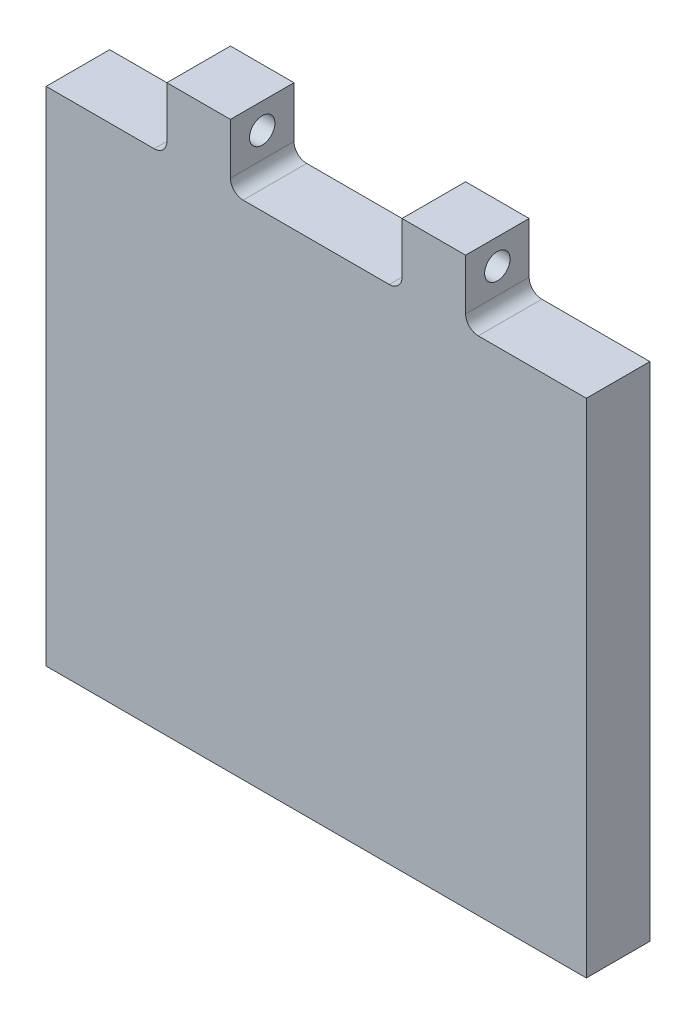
ISO-10303-21;
HEADER;
FILE_DESCRIPTION(('STEP AP214'),'2;1');
FILE_NAME('part.step','',(''),(''),'','','');
FILE_SCHEMA(('AUTOMOTIVE_DESIGN { 1 0 10303 214 1 1 1 1 }'));
ENDSEC;
DATA;
#1=APPLICATION_CONTEXT('core data for automotive mechanical design processes');
#2=APPLICATION_PROTOCOL_DEFINITION('international standard','automotive_design',2000,#1);
#3=PRODUCT_CONTEXT('',#1,'mechanical');
#4=PRODUCT('Part','Part','',(#3));
#5=PRODUCT_RELATED_PRODUCT_CATEGORY('part','',(#4));
#6=PRODUCT_DEFINITION_FORMATION('','',#4);
#7=PRODUCT_DEFINITION_CONTEXT('part definition',#1,'design');
#8=PRODUCT_DEFINITION('design','',#6,#7);
#9=PRODUCT_DEFINITION_SHAPE('','',#8);
#10=(LENGTH_UNIT() NAMED_UNIT(*) SI_UNIT(.MILLI.,.METRE.));
#11=(NAMED_UNIT(*) PLANE_ANGLE_UNIT() SI_UNIT($,.RADIAN.));
#12=(NAMED_UNIT(*) SI_UNIT($,.STERADIAN.) SOLID_ANGLE_UNIT());
#13=UNCERTAINTY_MEASURE_WITH_UNIT(LENGTH_MEASURE(1.E-05),#10,'distance_accuracy_value','');
#14=(GEOMETRIC_REPRESENTATION_CONTEXT(3) GLOBAL_UNCERTAINTY_ASSIGNED_CONTEXT((#13)) GLOBAL_UNIT_ASSIGNED_CONTEXT((#10,
#11,#12)) REPRESENTATION_CONTEXT('',''));
#15=CARTESIAN_POINT('',(0.,0.,0.));
#16=DIRECTION('',(0.,0.,1.));
#17=DIRECTION('',(1.,0.,0.));
#18=AXIS2_PLACEMENT_3D('',#15,#16,#17);
#19=CARTESIAN_POINT('',(-42.5,0.,-10.));
#20=DIRECTION('',(-1.,0.,0.));
#21=DIRECTION('',(0.,0.,1.));
#22=AXIS2_PLACEMENT_3D('',#19,#20,#21);
#23=PLANE('',#22);
#24=DIRECTION('',(0.,-1.,0.));
#25=VECTOR('',#24,1.);
#26=CARTESIAN_POINT('',(-42.5,0.,0.));
#27=LINE('',#26,#25);
#28=CARTESIAN_POINT('',(-42.5,79.,0.));
#29=VERTEX_POINT('',#28);
#30=CARTESIAN_POINT('',(-42.5,0.,0.));
#31=VERTEX_POINT('',#30);
#32=EDGE_CURVE('E139',#29,#31,#27,.T.);
#33=ORIENTED_EDGE('',*,*,#32,.F.);
#34=DIRECTION('',(0.,0.,1.));
#35=VECTOR('',#34,1.);
#36=CARTESIAN_POINT('',(-42.5,79.,-10.));
#37=LINE('',#36,#35);
#38=CARTESIAN_POINT('',(-42.5,79.,-10.));
#39=VERTEX_POINT('',#38);
#40=EDGE_CURVE('E11',#39,#29,#37,.T.);
#41=ORIENTED_EDGE('',*,*,#40,.F.);
#42=DIRECTION('',(0.,-1.,0.));
#43=VECTOR('',#42,1.);
#44=CARTESIAN_POINT('',(-42.5,0.,-10.));
#45=LINE('',#44,#43);
#46=CARTESIAN_POINT('',(-42.5,0.,-10.));
#47=VERTEX_POINT('',#46);
#48=EDGE_CURVE('E141',#39,#47,#45,.T.);
#49=ORIENTED_EDGE('',*,*,#48,.T.);
#50=DIRECTION('',(0.,0.,1.));
#51=VECTOR('',#50,1.);
#52=CARTESIAN_POINT('',(-42.5,0.,-10.));
#53=LINE('',#52,#51);
#54=EDGE_CURVE('E136',#47,#31,#53,.T.);
#55=ORIENTED_EDGE('',*,*,#54,.T.);
#56=EDGE_LOOP('',(#33,#41,#49,#55));
#57=FACE_BOUND('',#56,.T.);
#58=ADVANCED_FACE('F26',(#57),#23,.T.);
#59=CARTESIAN_POINT('',(-42.5,79.,-10.));
#60=DIRECTION('',(0.,1.,0.));
#61=DIRECTION('',(0.,0.,1.));
#62=AXIS2_PLACEMENT_3D('',#59,#60,#61);
#63=PLANE('',#62);
#64=DIRECTION('',(-1.,0.,0.));
#65=VECTOR('',#64,1.);
#66=CARTESIAN_POINT('',(-42.5,79.,0.));
#67=LINE('',#66,#65);
#68=CARTESIAN_POINT('',(-25.5,79.,0.));
#69=VERTEX_POINT('',#68);
#70=EDGE_CURVE('E157',#69,#29,#67,.T.);
#71=ORIENTED_EDGE('',*,*,#70,.F.);
#72=DIRECTION('',(0.,0.,1.));
#73=VECTOR('',#72,1.);
#74=CARTESIAN_POINT('',(-25.5,79.,-10.));
#75=LINE('',#74,#73);
#76=CARTESIAN_POINT('',(-25.5,79.,-10.));
#77=VERTEX_POINT('',#76);
#78=EDGE_CURVE('E34',#77,#69,#75,.T.);
#79=ORIENTED_EDGE('',*,*,#78,.F.);
#80=DIRECTION('',(-1.,0.,0.));
#81=VECTOR('',#80,1.);
#82=CARTESIAN_POINT('',(-42.5,79.,-10.));
#83=LINE('',#82,#81);
#84=EDGE_CURVE('E146',#77,#39,#83,.T.);
#85=ORIENTED_EDGE('',*,*,#84,.T.);
#86=ORIENTED_EDGE('',*,*,#40,.T.);
#87=EDGE_LOOP('',(#71,#79,#85,#86));
#88=FACE_BOUND('',#87,.T.);
#89=ADVANCED_FACE('F323',(#88),#63,.T.);
#90=CARTESIAN_POINT('',(-25.5,81.,-10.));
#91=DIRECTION('',(0.,0.,1.));
#92=DIRECTION('',(1.,0.,0.));
#93=AXIS2_PLACEMENT_3D('',#90,#91,#92);
#94=CYLINDRICAL_SURFACE('',#93,2.);
#95=CARTESIAN_POINT('',(-25.5,81.,0.));
#96=DIRECTION('',(0.,0.,-1.));
#97=DIRECTION('',(-1.,0.,0.));
#98=AXIS2_PLACEMENT_3D('',#95,#96,#97);
#99=CIRCLE('',#98,2.);
#100=CARTESIAN_POINT('',(-23.5,81.,0.));
#101=VERTEX_POINT('',#100);
#102=EDGE_CURVE('E199',#101,#69,#99,.T.);
#103=ORIENTED_EDGE('',*,*,#102,.F.);
#104=DIRECTION('',(0.,0.,1.));
#105=VECTOR('',#104,1.);
#106=CARTESIAN_POINT('',(-23.5,81.,-10.));
#107=LINE('',#106,#105);
#108=CARTESIAN_POINT('',(-23.5,81.,-10.));
#109=VERTEX_POINT('',#108);
#110=EDGE_CURVE('E245',#109,#101,#107,.T.);
#111=ORIENTED_EDGE('',*,*,#110,.F.);
#112=CARTESIAN_POINT('',(-25.5,81.,-10.));
#113=DIRECTION('',(0.,0.,-1.));
#114=DIRECTION('',(-1.,0.,0.));
#115=AXIS2_PLACEMENT_3D('',#112,#113,#114);
#116=CIRCLE('',#115,2.);
#117=EDGE_CURVE('E241',#109,#77,#116,.T.);
#118=ORIENTED_EDGE('',*,*,#117,.T.);
#119=ORIENTED_EDGE('',*,*,#78,.T.);
#120=EDGE_LOOP('',(#103,#111,#118,#119));
#121=FACE_BOUND('',#120,.T.);
#122=ADVANCED_FACE('F319',(#121),#94,.F.);
#123=CARTESIAN_POINT('',(-23.5,81.,-10.));
#124=DIRECTION('',(-1.,0.,0.));
#125=DIRECTION('',(0.,0.,1.));
#126=AXIS2_PLACEMENT_3D('',#123,#124,#125);
#127=PLANE('',#126);
#128=CARTESIAN_POINT('',(-23.5,85.,-5.));
#129=DIRECTION('',(-1.,0.,0.));
#130=DIRECTION('',(0.,0.,1.));
#131=AXIS2_PLACEMENT_3D('',#128,#129,#130);
#132=CIRCLE('',#131,2.);
#133=CARTESIAN_POINT('',(-23.5,85.,-3.));
#134=VERTEX_POINT('',#133);
#135=EDGE_CURVE('E384',#134,#134,#132,.T.);
#136=ORIENTED_EDGE('',*,*,#135,.F.);
#137=EDGE_LOOP('',(#136));
#138=FACE_BOUND('',#137,.T.);
#139=DIRECTION('',(0.,-1.,0.));
#140=VECTOR('',#139,1.);
#141=CARTESIAN_POINT('',(-23.5,81.,0.));
#142=LINE('',#141,#140);
#143=CARTESIAN_POINT('',(-23.5,89.,0.));
#144=VERTEX_POINT('',#143);
#145=EDGE_CURVE('E196',#144,#101,#142,.T.);
#146=ORIENTED_EDGE('',*,*,#145,.F.);
#147=DIRECTION('',(0.,0.,1.));
#148=VECTOR('',#147,1.);
#149=CARTESIAN_POINT('',(-23.5,89.,-10.));
#150=LINE('',#149,#148);
#151=CARTESIAN_POINT('',(-23.5,89.,-10.));
#152=VERTEX_POINT('',#151);
#153=EDGE_CURVE('E247',#152,#144,#150,.T.);
#154=ORIENTED_EDGE('',*,*,#153,.F.);
#155=DIRECTION('',(0.,-1.,0.));
#156=VECTOR('',#155,1.);
#157=CARTESIAN_POINT('',(-23.5,81.,-10.));
#158=LINE('',#157,#156);
#159=EDGE_CURVE('E238',#152,#109,#158,.T.);
#160=ORIENTED_EDGE('',*,*,#159,.T.);
#161=ORIENTED_EDGE('',*,*,#110,.T.);
#162=EDGE_LOOP('',(#146,#154,#160,#161));
#163=FACE_BOUND('',#162,.T.);
#164=ADVANCED_FACE('F315',(#138,#163),#127,.T.);
#165=CARTESIAN_POINT('',(-23.5,89.,-10.));
#166=DIRECTION('',(0.,1.,0.));
#167=DIRECTION('',(0.,0.,1.));
#168=AXIS2_PLACEMENT_3D('',#165,#166,#167);
#169=PLANE('',#168);
#170=DIRECTION('',(-1.,0.,0.));
#171=VECTOR('',#170,1.);
#172=CARTESIAN_POINT('',(-23.5,89.,0.));
#173=LINE('',#172,#171);
#174=CARTESIAN_POINT('',(-13.5,89.,0.));
#175=VERTEX_POINT('',#174);
#176=EDGE_CURVE('E193',#175,#144,#173,.T.);
#177=ORIENTED_EDGE('',*,*,#176,.F.);
#178=DIRECTION('',(0.,0.,1.));
#179=VECTOR('',#178,1.);
#180=CARTESIAN_POINT('',(-13.5,89.,-10.));
#181=LINE('',#180,#179);
#182=CARTESIAN_POINT('',(-13.5,89.,-10.));
#183=VERTEX_POINT('',#182);
#184=EDGE_CURVE('E249',#183,#175,#181,.T.);
#185=ORIENTED_EDGE('',*,*,#184,.F.);
#186=DIRECTION('',(-1.,0.,0.));
#187=VECTOR('',#186,1.);
#188=CARTESIAN_POINT('',(-23.5,89.,-10.));
#189=LINE('',#188,#187);
#190=EDGE_CURVE('E235',#183,#152,#189,.T.);
#191=ORIENTED_EDGE('',*,*,#190,.T.);
#192=ORIENTED_EDGE('',*,*,#153,.T.);
#193=EDGE_LOOP('',(#177,#185,#191,#192));
#194=FACE_BOUND('',#193,.T.);
#195=ADVANCED_FACE('F311',(#194),#169,.T.);
#196=CARTESIAN_POINT('',(-13.5,89.,-10.));
#197=DIRECTION('',(1.,0.,0.));
#198=DIRECTION('',(0.,1.,0.));
#199=AXIS2_PLACEMENT_3D('',#196,#197,#198);
#200=PLANE('',#199);
#201=CARTESIAN_POINT('',(-13.5,85.,-5.));
#202=DIRECTION('',(1.,0.,0.));
#203=DIRECTION('',(0.,1.,0.));
#204=AXIS2_PLACEMENT_3D('',#201,#202,#203);
#205=CIRCLE('',#204,2.);
#206=CARTESIAN_POINT('',(-13.5,87.,-5.));
#207=VERTEX_POINT('',#206);
#208=EDGE_CURVE('E158',#207,#207,#205,.T.);
#209=ORIENTED_EDGE('',*,*,#208,.F.);
#210=EDGE_LOOP('',(#209));
#211=FACE_BOUND('',#210,.T.);
#212=DIRECTION('',(0.,1.,0.));
#213=VECTOR('',#212,1.);
#214=CARTESIAN_POINT('',(-13.5,89.,0.));
#215=LINE('',#214,#213);
#216=CARTESIAN_POINT('',(-13.5,81.,0.));
#217=VERTEX_POINT('',#216);
#218=EDGE_CURVE('E190',#217,#175,#215,.T.);
#219=ORIENTED_EDGE('',*,*,#218,.F.);
#220=DIRECTION('',(0.,0.,1.));
#221=VECTOR('',#220,1.);
#222=CARTESIAN_POINT('',(-13.5,81.,-10.));
#223=LINE('',#222,#221);
#224=CARTESIAN_POINT('',(-13.5,81.,-10.));
#225=VERTEX_POINT('',#224);
#226=EDGE_CURVE('E251',#225,#217,#223,.T.);
#227=ORIENTED_EDGE('',*,*,#226,.F.);
#228=DIRECTION('',(0.,1.,0.));
#229=VECTOR('',#228,1.);
#230=CARTESIAN_POINT('',(-13.5,89.,-10.));
#231=LINE('',#230,#229);
#232=EDGE_CURVE('E232',#225,#183,#231,.T.);
#233=ORIENTED_EDGE('',*,*,#232,.T.);
#234=ORIENTED_EDGE('',*,*,#184,.T.);
#235=EDGE_LOOP('',(#219,#227,#233,#234));
#236=FACE_BOUND('',#235,.T.);
#237=ADVANCED_FACE('F307',(#211,#236),#200,.T.);
#238=CARTESIAN_POINT('',(-11.5,81.,-10.));
#239=DIRECTION('',(0.,0.,1.));
#240=DIRECTION('',(1.,0.,0.));
#241=AXIS2_PLACEMENT_3D('',#238,#239,#240);
#242=CYLINDRICAL_SURFACE('',#241,2.);
#243=CARTESIAN_POINT('',(-11.5,81.,0.));
#244=DIRECTION('',(0.,0.,-1.));
#245=DIRECTION('',(-1.,0.,0.));
#246=AXIS2_PLACEMENT_3D('',#243,#244,#245);
#247=CIRCLE('',#246,2.);
#248=CARTESIAN_POINT('',(-11.5,79.,0.));
#249=VERTEX_POINT('',#248);
#250=EDGE_CURVE('E187',#249,#217,#247,.T.);
#251=ORIENTED_EDGE('',*,*,#250,.F.);
#252=DIRECTION('',(0.,0.,1.));
#253=VECTOR('',#252,1.);
#254=CARTESIAN_POINT('',(-11.5,79.,-10.));
#255=LINE('',#254,#253);
#256=CARTESIAN_POINT('',(-11.5,79.,-10.));
#257=VERTEX_POINT('',#256);
#258=EDGE_CURVE('E253',#257,#249,#255,.T.);
#259=ORIENTED_EDGE('',*,*,#258,.F.);
#260=CARTESIAN_POINT('',(-11.5,81.,-10.));
#261=DIRECTION('',(0.,0.,-1.));
#262=DIRECTION('',(-1.,0.,0.));
#263=AXIS2_PLACEMENT_3D('',#260,#261,#262);
#264=CIRCLE('',#263,2.);
#265=EDGE_CURVE('E229',#257,#225,#264,.T.);
#266=ORIENTED_EDGE('',*,*,#265,.T.);
#267=ORIENTED_EDGE('',*,*,#226,.T.);
#268=EDGE_LOOP('',(#251,#259,#266,#267));
#269=FACE_BOUND('',#268,.T.);
#270=ADVANCED_FACE('F303',(#269),#242,.F.);
#271=CARTESIAN_POINT('',(-11.5,79.,-10.));
#272=DIRECTION('',(0.,1.,0.));
#273=DIRECTION('',(0.,0.,1.));
#274=AXIS2_PLACEMENT_3D('',#271,#272,#273);
#275=PLANE('',#274);
#276=DIRECTION('',(-1.,0.,0.));
#277=VECTOR('',#276,1.);
#278=CARTESIAN_POINT('',(-11.5,79.,0.));
#279=LINE('',#278,#277);
#280=CARTESIAN_POINT('',(11.5,79.,0.));
#281=VERTEX_POINT('',#280);
#282=EDGE_CURVE('E184',#281,#249,#279,.T.);
#283=ORIENTED_EDGE('',*,*,#282,.F.);
#284=DIRECTION('',(0.,0.,1.));
#285=VECTOR('',#284,1.);
#286=CARTESIAN_POINT('',(11.5,79.,-10.));
#287=LINE('',#286,#285);
#288=CARTESIAN_POINT('',(11.5,79.,-10.));
#289=VERTEX_POINT('',#288);
#290=EDGE_CURVE('E255',#289,#281,#287,.T.);
#291=ORIENTED_EDGE('',*,*,#290,.F.);
#292=DIRECTION('',(-1.,0.,0.));
#293=VECTOR('',#292,1.);
#294=CARTESIAN_POINT('',(-11.5,79.,-10.));
#295=LINE('',#294,#293);
#296=EDGE_CURVE('E226',#289,#257,#295,.T.);
#297=ORIENTED_EDGE('',*,*,#296,.T.);
#298=ORIENTED_EDGE('',*,*,#258,.T.);
#299=EDGE_LOOP('',(#283,#291,#297,#298));
#300=FACE_BOUND('',#299,.T.);
#301=ADVANCED_FACE('F299',(#300),#275,.T.);
#302=CARTESIAN_POINT('',(11.5,81.,-10.));
#303=DIRECTION('',(0.,0.,1.));
#304=DIRECTION('',(1.,0.,0.));
#305=AXIS2_PLACEMENT_3D('',#302,#303,#304);
#306=CYLINDRICAL_SURFACE('',#305,2.);
#307=CARTESIAN_POINT('',(11.5,81.,0.));
#308=DIRECTION('',(0.,0.,-1.));
#309=DIRECTION('',(1.,0.,0.));
#310=AXIS2_PLACEMENT_3D('',#307,#308,#309);
#311=CIRCLE('',#310,2.);
#312=CARTESIAN_POINT('',(13.5,81.,0.));
#313=VERTEX_POINT('',#312);
#314=EDGE_CURVE('E181',#313,#281,#311,.T.);
#315=ORIENTED_EDGE('',*,*,#314,.F.);
#316=DIRECTION('',(0.,0.,1.));
#317=VECTOR('',#316,1.);
#318=CARTESIAN_POINT('',(13.5,81.,-10.));
#319=LINE('',#318,#317);
#320=CARTESIAN_POINT('',(13.5,81.,-10.));
#321=VERTEX_POINT('',#320);
#322=EDGE_CURVE('E257',#321,#313,#319,.T.);
#323=ORIENTED_EDGE('',*,*,#322,.F.);
#324=CARTESIAN_POINT('',(11.5,81.,-10.));
#325=DIRECTION('',(0.,0.,-1.));
#326=DIRECTION('',(1.,0.,0.));
#327=AXIS2_PLACEMENT_3D('',#324,#325,#326);
#328=CIRCLE('',#327,2.);
#329=EDGE_CURVE('E223',#321,#289,#328,.T.);
#330=ORIENTED_EDGE('',*,*,#329,.T.);
#331=ORIENTED_EDGE('',*,*,#290,.T.);
#332=EDGE_LOOP('',(#315,#323,#330,#331));
#333=FACE_BOUND('',#332,.T.);
#334=ADVANCED_FACE('F295',(#333),#306,.F.);
#335=CARTESIAN_POINT('',(13.5,89.,-10.));
#336=DIRECTION('',(-1.,0.,0.));
#337=DIRECTION('',(0.,-1.,0.));
#338=AXIS2_PLACEMENT_3D('',#335,#336,#337);
#339=PLANE('',#338);
#340=CARTESIAN_POINT('',(13.5,85.,-5.));
#341=DIRECTION('',(-1.,0.,0.));
#342=DIRECTION('',(0.,-1.,0.));
#343=AXIS2_PLACEMENT_3D('',#340,#341,#342);
#344=CIRCLE('',#343,2.);
#345=CARTESIAN_POINT('',(13.5,83.,-5.));
#346=VERTEX_POINT('',#345);
#347=EDGE_CURVE('E161',#346,#346,#344,.T.);
#348=ORIENTED_EDGE('',*,*,#347,.F.);
#349=EDGE_LOOP('',(#348));
#350=FACE_BOUND('',#349,.T.);
#351=DIRECTION('',(0.,-1.,0.));
#352=VECTOR('',#351,1.);
#353=CARTESIAN_POINT('',(13.5,89.,0.));
#354=LINE('',#353,#352);
#355=CARTESIAN_POINT('',(13.5,89.,0.));
#356=VERTEX_POINT('',#355);
#357=EDGE_CURVE('E178',#356,#313,#354,.T.);
#358=ORIENTED_EDGE('',*,*,#357,.F.);
#359=DIRECTION('',(0.,0.,1.));
#360=VECTOR('',#359,1.);
#361=CARTESIAN_POINT('',(13.5,89.,-10.));
#362=LINE('',#361,#360);
#363=CARTESIAN_POINT('',(13.5,89.,-10.));
#364=VERTEX_POINT('',#363);
#365=EDGE_CURVE('E259',#364,#356,#362,.T.);
#366=ORIENTED_EDGE('',*,*,#365,.F.);
#367=DIRECTION('',(0.,-1.,0.));
#368=VECTOR('',#367,1.);
#369=CARTESIAN_POINT('',(13.5,89.,-10.));
#370=LINE('',#369,#368);
#371=EDGE_CURVE('E220',#364,#321,#370,.T.);
#372=ORIENTED_EDGE('',*,*,#371,.T.);
#373=ORIENTED_EDGE('',*,*,#322,.T.);
#374=EDGE_LOOP('',(#358,#366,#372,#373));
#375=FACE_BOUND('',#374,.T.);
#376=ADVANCED_FACE('F291',(#350,#375),#339,.T.);
#377=CARTESIAN_POINT('',(23.5,89.,-10.));
#378=DIRECTION('',(0.,1.,0.));
#379=DIRECTION('',(0.,0.,1.));
#380=AXIS2_PLACEMENT_3D('',#377,#378,#379);
#381=PLANE('',#380);
#382=DIRECTION('',(-1.,0.,0.));
#383=VECTOR('',#382,1.);
#384=CARTESIAN_POINT('',(23.5,89.,0.));
#385=LINE('',#384,#383);
#386=CARTESIAN_POINT('',(23.5,89.,0.));
#387=VERTEX_POINT('',#386);
#388=EDGE_CURVE('E175',#387,#356,#385,.T.);
#389=ORIENTED_EDGE('',*,*,#388,.F.);
#390=DIRECTION('',(0.,0.,1.));
#391=VECTOR('',#390,1.);
#392=CARTESIAN_POINT('',(23.5,89.,-10.));
#393=LINE('',#392,#391);
#394=CARTESIAN_POINT('',(23.5,89.,-10.));
#395=VERTEX_POINT('',#394);
#396=EDGE_CURVE('E261',#395,#387,#393,.T.);
#397=ORIENTED_EDGE('',*,*,#396,.F.);
#398=DIRECTION('',(-1.,0.,0.));
#399=VECTOR('',#398,1.);
#400=CARTESIAN_POINT('',(23.5,89.,-10.));
#401=LINE('',#400,#399);
#402=EDGE_CURVE('E217',#395,#364,#401,.T.);
#403=ORIENTED_EDGE('',*,*,#402,.T.);
#404=ORIENTED_EDGE('',*,*,#365,.T.);
#405=EDGE_LOOP('',(#389,#397,#403,#404));
#406=FACE_BOUND('',#405,.T.);
#407=ADVANCED_FACE('F287',(#406),#381,.T.);
#408=CARTESIAN_POINT('',(23.5,81.,-10.));
#409=DIRECTION('',(1.,0.,0.));
#410=DIRECTION('',(0.,0.,-1.));
#411=AXIS2_PLACEMENT_3D('',#408,#409,#410);
#412=PLANE('',#411);
#413=CARTESIAN_POINT('',(23.5,85.,-5.));
#414=DIRECTION('',(1.,0.,0.));
#415=DIRECTION('',(0.,0.,-1.));
#416=AXIS2_PLACEMENT_3D('',#413,#414,#415);
#417=CIRCLE('',#416,2.);
#418=CARTESIAN_POINT('',(23.5,85.,-7.));
#419=VERTEX_POINT('',#418);
#420=EDGE_CURVE('E29',#419,#419,#417,.T.);
#421=ORIENTED_EDGE('',*,*,#420,.F.);
#422=EDGE_LOOP('',(#421));
#423=FACE_BOUND('',#422,.T.);
#424=DIRECTION('',(0.,1.,0.));
#425=VECTOR('',#424,1.);
#426=CARTESIAN_POINT('',(23.5,81.,0.));
#427=LINE('',#426,#425);
#428=CARTESIAN_POINT('',(23.5,81.,0.));
#429=VERTEX_POINT('',#428);
#430=EDGE_CURVE('E172',#429,#387,#427,.T.);
#431=ORIENTED_EDGE('',*,*,#430,.F.);
#432=DIRECTION('',(0.,0.,1.));
#433=VECTOR('',#432,1.);
#434=CARTESIAN_POINT('',(23.5,81.,-10.));
#435=LINE('',#434,#433);
#436=CARTESIAN_POINT('',(23.5,81.,-10.));
#437=VERTEX_POINT('',#436);
#438=EDGE_CURVE('E263',#437,#429,#435,.T.);
#439=ORIENTED_EDGE('',*,*,#438,.F.);
#440=DIRECTION('',(0.,1.,0.));
#441=VECTOR('',#440,1.);
#442=CARTESIAN_POINT('',(23.5,81.,-10.));
#443=LINE('',#442,#441);
#444=EDGE_CURVE('E214',#437,#395,#443,.T.);
#445=ORIENTED_EDGE('',*,*,#444,.T.);
#446=ORIENTED_EDGE('',*,*,#396,.T.);
#447=EDGE_LOOP('',(#431,#439,#445,#446));
#448=FACE_BOUND('',#447,.T.);
#449=ADVANCED_FACE('F283',(#423,#448),#412,.T.);
#450=CARTESIAN_POINT('',(25.5,81.,-10.));
#451=DIRECTION('',(0.,0.,1.));
#452=DIRECTION('',(1.,0.,0.));
#453=AXIS2_PLACEMENT_3D('',#450,#451,#452);
#454=CYLINDRICAL_SURFACE('',#453,2.);
#455=CARTESIAN_POINT('',(25.5,81.,0.));
#456=DIRECTION('',(0.,0.,-1.));
#457=DIRECTION('',(1.,0.,0.));
#458=AXIS2_PLACEMENT_3D('',#455,#456,#457);
#459=CIRCLE('',#458,2.);
#460=CARTESIAN_POINT('',(25.5,79.,0.));
#461=VERTEX_POINT('',#460);
#462=EDGE_CURVE('E169',#461,#429,#459,.T.);
#463=ORIENTED_EDGE('',*,*,#462,.F.);
#464=DIRECTION('',(0.,0.,1.));
#465=VECTOR('',#464,1.);
#466=CARTESIAN_POINT('',(25.5,79.,-10.));
#467=LINE('',#466,#465);
#468=CARTESIAN_POINT('',(25.5,79.,-10.));
#469=VERTEX_POINT('',#468);
#470=EDGE_CURVE('E265',#469,#461,#467,.T.);
#471=ORIENTED_EDGE('',*,*,#470,.F.);
#472=CARTESIAN_POINT('',(25.5,81.,-10.));
#473=DIRECTION('',(0.,0.,-1.));
#474=DIRECTION('',(1.,0.,0.));
#475=AXIS2_PLACEMENT_3D('',#472,#473,#474);
#476=CIRCLE('',#475,2.);
#477=EDGE_CURVE('E211',#469,#437,#476,.T.);
#478=ORIENTED_EDGE('',*,*,#477,.T.);
#479=ORIENTED_EDGE('',*,*,#438,.T.);
#480=EDGE_LOOP('',(#463,#471,#478,#479));
#481=FACE_BOUND('',#480,.T.);
#482=ADVANCED_FACE('F279',(#481),#454,.F.);
#483=CARTESIAN_POINT('',(42.5,79.,-10.));
#484=DIRECTION('',(0.,1.,0.));
#485=DIRECTION('',(0.,0.,1.));
#486=AXIS2_PLACEMENT_3D('',#483,#484,#485);
#487=PLANE('',#486);
#488=DIRECTION('',(-1.,0.,0.));
#489=VECTOR('',#488,1.);
#490=CARTESIAN_POINT('',(42.5,79.,0.));
#491=LINE('',#490,#489);
#492=CARTESIAN_POINT('',(42.5,79.,0.));
#493=VERTEX_POINT('',#492);
#494=EDGE_CURVE('E166',#493,#461,#491,.T.);
#495=ORIENTED_EDGE('',*,*,#494,.F.);
#496=DIRECTION('',(0.,0.,1.));
#497=VECTOR('',#496,1.);
#498=CARTESIAN_POINT('',(42.5,79.,-10.));
#499=LINE('',#498,#497);
#500=CARTESIAN_POINT('',(42.5,79.,-10.));
#501=VERTEX_POINT('',#500);
#502=EDGE_CURVE('E267',#501,#493,#499,.T.);
#503=ORIENTED_EDGE('',*,*,#502,.F.);
#504=DIRECTION('',(-1.,0.,0.));
#505=VECTOR('',#504,1.);
#506=CARTESIAN_POINT('',(42.5,79.,-10.));
#507=LINE('',#506,#505);
#508=EDGE_CURVE('E208',#501,#469,#507,.T.);
#509=ORIENTED_EDGE('',*,*,#508,.T.);
#510=ORIENTED_EDGE('',*,*,#470,.T.);
#511=EDGE_LOOP('',(#495,#503,#509,#510));
#512=FACE_BOUND('',#511,.T.);
#513=ADVANCED_FACE('F275',(#512),#487,.T.);
#514=CARTESIAN_POINT('',(42.5,0.,-10.));
#515=DIRECTION('',(1.,0.,0.));
#516=DIRECTION('',(0.,0.,-1.));
#517=AXIS2_PLACEMENT_3D('',#514,#515,#516);
#518=PLANE('',#517);
#519=DIRECTION('',(0.,1.,0.));
#520=VECTOR('',#519,1.);
#521=CARTESIAN_POINT('',(42.5,0.,0.));
#522=LINE('',#521,#520);
#523=CARTESIAN_POINT('',(42.5,0.,0.));
#524=VERTEX_POINT('',#523);
#525=EDGE_CURVE('E153',#524,#493,#522,.T.);
#526=ORIENTED_EDGE('',*,*,#525,.F.);
#527=DIRECTION('',(0.,0.,1.));
#528=VECTOR('',#527,1.);
#529=CARTESIAN_POINT('',(42.5,0.,-10.));
#530=LINE('',#529,#528);
#531=CARTESIAN_POINT('',(42.5,0.,-10.));
#532=VERTEX_POINT('',#531);
#533=EDGE_CURVE('E145',#532,#524,#530,.T.);
#534=ORIENTED_EDGE('',*,*,#533,.F.);
#535=DIRECTION('',(0.,1.,0.));
#536=VECTOR('',#535,1.);
#537=CARTESIAN_POINT('',(42.5,0.,-10.));
#538=LINE('',#537,#536);
#539=EDGE_CURVE('E205',#532,#501,#538,.T.);
#540=ORIENTED_EDGE('',*,*,#539,.T.);
#541=ORIENTED_EDGE('',*,*,#502,.T.);
#542=EDGE_LOOP('',(#526,#534,#540,#541));
#543=FACE_BOUND('',#542,.T.);
#544=ADVANCED_FACE('F271',(#543),#518,.T.);
#545=CARTESIAN_POINT('',(42.5,0.,-10.));
#546=DIRECTION('',(0.,-1.,0.));
#547=DIRECTION('',(0.,0.,-1.));
#548=AXIS2_PLACEMENT_3D('',#545,#546,#547);
#549=PLANE('',#548);
#550=DIRECTION('',(1.,0.,0.));
#551=VECTOR('',#550,1.);
#552=CARTESIAN_POINT('',(42.5,0.,0.));
#553=LINE('',#552,#551);
#554=EDGE_CURVE('E148',#31,#524,#553,.T.);
#555=ORIENTED_EDGE('',*,*,#554,.F.);
#556=ORIENTED_EDGE('',*,*,#54,.F.);
#557=DIRECTION('',(1.,0.,0.));
#558=VECTOR('',#557,1.);
#559=CARTESIAN_POINT('',(42.5,0.,-10.));
#560=LINE('',#559,#558);
#561=EDGE_CURVE('E203',#47,#532,#560,.T.);
#562=ORIENTED_EDGE('',*,*,#561,.T.);
#563=ORIENTED_EDGE('',*,*,#533,.T.);
#564=EDGE_LOOP('',(#555,#556,#562,#563));
#565=FACE_BOUND('',#564,.T.);
#566=ADVANCED_FACE('F149',(#565),#549,.T.);
#567=CARTESIAN_POINT('',(-25.5,81.,-10.));
#568=DIRECTION('',(0.,0.,-1.));
#569=DIRECTION('',(-1.,0.,0.));
#570=AXIS2_PLACEMENT_3D('',#567,#568,#569);
#571=PLANE('',#570);
#572=ORIENTED_EDGE('',*,*,#48,.F.);
#573=ORIENTED_EDGE('',*,*,#84,.F.);
#574=ORIENTED_EDGE('',*,*,#117,.F.);
#575=ORIENTED_EDGE('',*,*,#159,.F.);
#576=ORIENTED_EDGE('',*,*,#190,.F.);
#577=ORIENTED_EDGE('',*,*,#232,.F.);
#578=ORIENTED_EDGE('',*,*,#265,.F.);
#579=ORIENTED_EDGE('',*,*,#296,.F.);
#580=ORIENTED_EDGE('',*,*,#329,.F.);
#581=ORIENTED_EDGE('',*,*,#371,.F.);
#582=ORIENTED_EDGE('',*,*,#402,.F.);
#583=ORIENTED_EDGE('',*,*,#444,.F.);
#584=ORIENTED_EDGE('',*,*,#477,.F.);
#585=ORIENTED_EDGE('',*,*,#508,.F.);
#586=ORIENTED_EDGE('',*,*,#539,.F.);
#587=ORIENTED_EDGE('',*,*,#561,.F.);
#588=EDGE_LOOP('',(#572,#573,#574,#575,#576,#577,#578,#579,#580,#581,#582,#583,#584,#585,#586,#587));
#589=FACE_BOUND('',#588,.T.);
#590=ADVANCED_FACE('F322',(#589),#571,.T.);
#591=CARTESIAN_POINT('',(-25.5,81.,0.));
#592=DIRECTION('',(0.,0.,-1.));
#593=DIRECTION('',(-1.,0.,0.));
#594=AXIS2_PLACEMENT_3D('',#591,#592,#593);
#595=PLANE('',#594);
#596=ORIENTED_EDGE('',*,*,#32,.T.);
#597=ORIENTED_EDGE('',*,*,#554,.T.);
#598=ORIENTED_EDGE('',*,*,#525,.T.);
#599=ORIENTED_EDGE('',*,*,#494,.T.);
#600=ORIENTED_EDGE('',*,*,#462,.T.);
#601=ORIENTED_EDGE('',*,*,#430,.T.);
#602=ORIENTED_EDGE('',*,*,#388,.T.);
#603=ORIENTED_EDGE('',*,*,#357,.T.);
#604=ORIENTED_EDGE('',*,*,#314,.T.);
#605=ORIENTED_EDGE('',*,*,#282,.T.);
#606=ORIENTED_EDGE('',*,*,#250,.T.);
#607=ORIENTED_EDGE('',*,*,#218,.T.);
#608=ORIENTED_EDGE('',*,*,#176,.T.);
#609=ORIENTED_EDGE('',*,*,#145,.T.);
#610=ORIENTED_EDGE('',*,*,#102,.T.);
#611=ORIENTED_EDGE('',*,*,#70,.T.);
#612=EDGE_LOOP('',(#596,#597,#598,#599,#600,#601,#602,#603,#604,#605,#606,#607,#608,#609,#610,#611));
#613=FACE_BOUND('',#612,.T.);
#614=ADVANCED_FACE('F155',(#613),#595,.F.);
#615=CARTESIAN_POINT('',(42.5,85.,-5.));
#616=DIRECTION('',(-1.,0.,0.));
#617=DIRECTION('',(0.,0.,1.));
#618=AXIS2_PLACEMENT_3D('',#615,#616,#617);
#619=CYLINDRICAL_SURFACE('',#618,2.);
#620=ORIENTED_EDGE('',*,*,#347,.T.);
#621=EDGE_LOOP('',(#620));
#622=FACE_BOUND('',#621,.T.);
#623=ORIENTED_EDGE('',*,*,#420,.T.);
#624=EDGE_LOOP('',(#623));
#625=FACE_BOUND('',#624,.T.);
#626=ADVANCED_FACE('F368',(#622,#625),#619,.F.);
#627=ORIENTED_EDGE('',*,*,#208,.T.);
#628=EDGE_LOOP('',(#627));
#629=FACE_BOUND('',#628,.T.);
#630=ORIENTED_EDGE('',*,*,#135,.T.);
#631=EDGE_LOOP('',(#630));
#632=FACE_BOUND('',#631,.T.);
#633=ADVANCED_FACE('F372',(#629,#632),#619,.F.);
#634=CLOSED_SHELL('',(#58,#89,#122,#164,#195,#237,#270,#301,#334,#376,#407,#449,#482,#513,#544,
#566,#590,#614,#626,#633));
#635=MANIFOLD_SOLID_BREP('B2',#634);
#636=ADVANCED_BREP_SHAPE_REPRESENTATION('',(#18,#635),#14);
#637=SHAPE_DEFINITION_REPRESENTATION(#9,#636);
ENDSEC;
END-ISO-10303-21;
